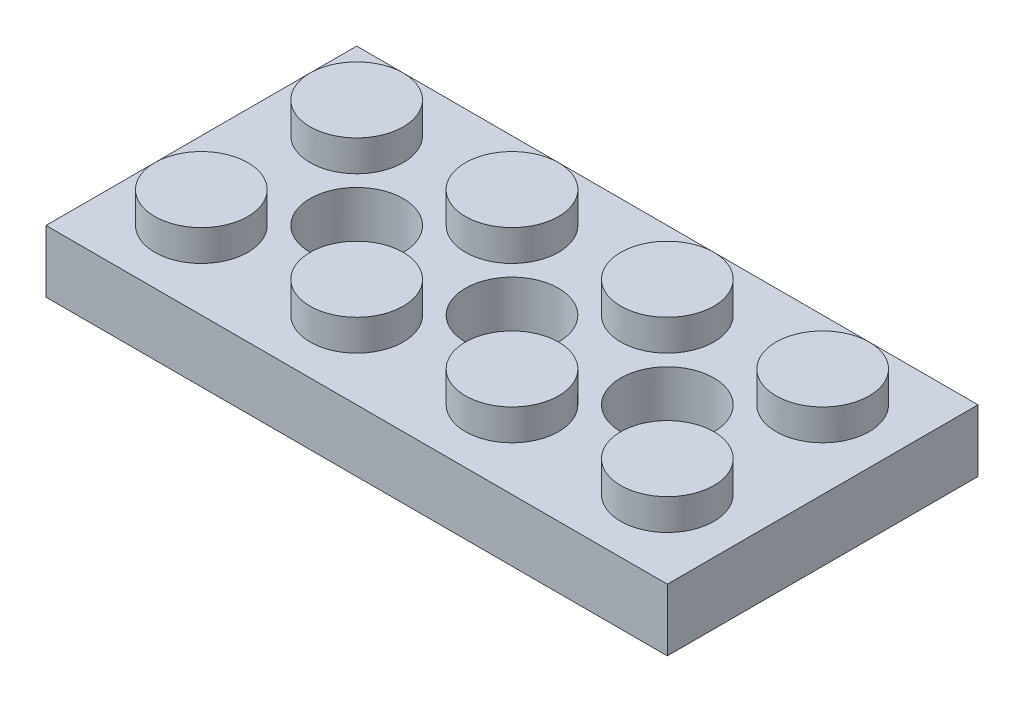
ISO-10303-21;
HEADER;
FILE_DESCRIPTION(('STEP AP214'),'2;1');
FILE_NAME('part.step','',(''),(''),'','','');
FILE_SCHEMA(('AUTOMOTIVE_DESIGN { 1 0 10303 214 1 1 1 1 }'));
ENDSEC;
DATA;
#1=APPLICATION_CONTEXT('core data for automotive mechanical design processes');
#2=APPLICATION_PROTOCOL_DEFINITION('international standard','automotive_design',2000,#1);
#3=PRODUCT_CONTEXT('',#1,'mechanical');
#4=PRODUCT('Part','Part','',(#3));
#5=PRODUCT_RELATED_PRODUCT_CATEGORY('part','',(#4));
#6=PRODUCT_DEFINITION_FORMATION('','',#4);
#7=PRODUCT_DEFINITION_CONTEXT('part definition',#1,'design');
#8=PRODUCT_DEFINITION('design','',#6,#7);
#9=PRODUCT_DEFINITION_SHAPE('','',#8);
#10=(LENGTH_UNIT() NAMED_UNIT(*) SI_UNIT(.MILLI.,.METRE.));
#11=(NAMED_UNIT(*) PLANE_ANGLE_UNIT() SI_UNIT($,.RADIAN.));
#12=(NAMED_UNIT(*) SI_UNIT($,.STERADIAN.) SOLID_ANGLE_UNIT());
#13=UNCERTAINTY_MEASURE_WITH_UNIT(LENGTH_MEASURE(1.E-05),#10,'distance_accuracy_value','');
#14=(GEOMETRIC_REPRESENTATION_CONTEXT(3) GLOBAL_UNCERTAINTY_ASSIGNED_CONTEXT((#13)) GLOBAL_UNIT_ASSIGNED_CONTEXT((#10,
#11,#12)) REPRESENTATION_CONTEXT('',''));
#15=CARTESIAN_POINT('',(0.,0.,0.));
#16=DIRECTION('',(0.,0.,1.));
#17=DIRECTION('',(1.,0.,0.));
#18=AXIS2_PLACEMENT_3D('',#15,#16,#17);
#19=CARTESIAN_POINT('',(0.,0.,0.));
#20=DIRECTION('',(0.,-1.,0.));
#21=DIRECTION('',(0.,0.,-1.));
#22=AXIS2_PLACEMENT_3D('',#19,#20,#21);
#23=PLANE('',#22);
#24=DIRECTION('',(0.,0.,-1.));
#25=VECTOR('',#24,1.);
#26=CARTESIAN_POINT('',(16.,0.,4.));
#27=LINE('',#26,#25);
#28=CARTESIAN_POINT('',(16.,0.,12.));
#29=VERTEX_POINT('',#28);
#30=CARTESIAN_POINT('',(16.,0.,-4.));
#31=VERTEX_POINT('',#30);
#32=EDGE_CURVE('E86',#29,#31,#27,.T.);
#33=ORIENTED_EDGE('',*,*,#32,.F.);
#34=DIRECTION('',(-1.,0.,0.));
#35=VECTOR('',#34,1.);
#36=CARTESIAN_POINT('',(-16.,0.,12.));
#37=LINE('',#36,#35);
#38=CARTESIAN_POINT('',(-16.,0.,12.));
#39=VERTEX_POINT('',#38);
#40=EDGE_CURVE('E99',#29,#39,#37,.T.);
#41=ORIENTED_EDGE('',*,*,#40,.T.);
#42=DIRECTION('',(0.,0.,1.));
#43=VECTOR('',#42,1.);
#44=CARTESIAN_POINT('',(-16.,0.,4.));
#45=LINE('',#44,#43);
#46=CARTESIAN_POINT('',(-16.,0.,-4.));
#47=VERTEX_POINT('',#46);
#48=EDGE_CURVE('E85',#47,#39,#45,.T.);
#49=ORIENTED_EDGE('',*,*,#48,.F.);
#50=DIRECTION('',(-1.,0.,0.));
#51=VECTOR('',#50,1.);
#52=CARTESIAN_POINT('',(-16.,0.,-4.));
#53=LINE('',#52,#51);
#54=EDGE_CURVE('E74',#31,#47,#53,.T.);
#55=ORIENTED_EDGE('',*,*,#54,.F.);
#56=EDGE_LOOP('',(#33,#41,#49,#55));
#57=FACE_BOUND('',#56,.T.);
#58=DIRECTION('',(-1.,0.,0.));
#59=VECTOR('',#58,1.);
#60=CARTESIAN_POINT('',(0.,0.,10.4));
#61=LINE('',#60,#59);
#62=CARTESIAN_POINT('',(14.4,0.,10.4));
#63=VERTEX_POINT('',#62);
#64=CARTESIAN_POINT('',(-14.4,0.,10.4));
#65=VERTEX_POINT('',#64);
#66=EDGE_CURVE('E185',#63,#65,#61,.T.);
#67=ORIENTED_EDGE('',*,*,#66,.F.);
#68=DIRECTION('',(0.,0.,-1.));
#69=VECTOR('',#68,1.);
#70=CARTESIAN_POINT('',(14.4,0.,0.));
#71=LINE('',#70,#69);
#72=CARTESIAN_POINT('',(14.4,0.,-2.4));
#73=VERTEX_POINT('',#72);
#74=EDGE_CURVE('E182',#63,#73,#71,.T.);
#75=ORIENTED_EDGE('',*,*,#74,.T.);
#76=DIRECTION('',(-1.,0.,0.));
#77=VECTOR('',#76,1.);
#78=CARTESIAN_POINT('',(0.,0.,-2.4));
#79=LINE('',#78,#77);
#80=CARTESIAN_POINT('',(-14.4,0.,-2.4));
#81=VERTEX_POINT('',#80);
#82=EDGE_CURVE('E179',#73,#81,#79,.T.);
#83=ORIENTED_EDGE('',*,*,#82,.T.);
#84=DIRECTION('',(0.,0.,1.));
#85=VECTOR('',#84,1.);
#86=CARTESIAN_POINT('',(-14.4,0.,0.));
#87=LINE('',#86,#85);
#88=EDGE_CURVE('E53',#81,#65,#87,.T.);
#89=ORIENTED_EDGE('',*,*,#88,.T.);
#90=EDGE_LOOP('',(#67,#75,#83,#89));
#91=FACE_BOUND('',#90,.T.);
#92=ADVANCED_FACE('F38',(#57,#91),#23,.T.);
#93=CARTESIAN_POINT('',(16.,3.2,4.));
#94=DIRECTION('',(-1.,0.,0.));
#95=DIRECTION('',(0.,0.,1.));
#96=AXIS2_PLACEMENT_3D('',#93,#94,#95);
#97=PLANE('',#96);
#98=ORIENTED_EDGE('',*,*,#32,.T.);
#99=DIRECTION('',(0.,-1.,0.));
#100=VECTOR('',#99,1.);
#101=CARTESIAN_POINT('',(16.,3.2,-4.));
#102=LINE('',#101,#100);
#103=CARTESIAN_POINT('',(16.,3.2,-4.));
#104=VERTEX_POINT('',#103);
#105=EDGE_CURVE('E80',#104,#31,#102,.T.);
#106=ORIENTED_EDGE('',*,*,#105,.F.);
#107=DIRECTION('',(0.,0.,-1.));
#108=VECTOR('',#107,1.);
#109=CARTESIAN_POINT('',(16.,3.2,4.));
#110=LINE('',#109,#108);
#111=CARTESIAN_POINT('',(16.,3.2,12.));
#112=VERTEX_POINT('',#111);
#113=EDGE_CURVE('E100',#112,#104,#110,.T.);
#114=ORIENTED_EDGE('',*,*,#113,.F.);
#115=DIRECTION('',(0.,-1.,0.));
#116=VECTOR('',#115,1.);
#117=CARTESIAN_POINT('',(16.,3.2,12.));
#118=LINE('',#117,#116);
#119=EDGE_CURVE('E133',#112,#29,#118,.T.);
#120=ORIENTED_EDGE('',*,*,#119,.T.);
#121=EDGE_LOOP('',(#98,#106,#114,#120));
#122=FACE_BOUND('',#121,.T.);
#123=ADVANCED_FACE('F40',(#122),#97,.F.);
#124=CARTESIAN_POINT('',(-16.,3.2,-4.));
#125=DIRECTION('',(0.,0.,1.));
#126=DIRECTION('',(1.,0.,0.));
#127=AXIS2_PLACEMENT_3D('',#124,#125,#126);
#128=PLANE('',#127);
#129=ORIENTED_EDGE('',*,*,#54,.T.);
#130=DIRECTION('',(0.,-1.,0.));
#131=VECTOR('',#130,1.);
#132=CARTESIAN_POINT('',(-16.,3.2,-4.));
#133=LINE('',#132,#131);
#134=CARTESIAN_POINT('',(-16.,3.2,-4.));
#135=VERTEX_POINT('',#134);
#136=EDGE_CURVE('E77',#135,#47,#133,.T.);
#137=ORIENTED_EDGE('',*,*,#136,.F.);
#138=DIRECTION('',(-1.,0.,0.));
#139=VECTOR('',#138,1.);
#140=CARTESIAN_POINT('',(-16.,3.2,-4.));
#141=LINE('',#140,#139);
#142=EDGE_CURVE('E62',#104,#135,#141,.T.);
#143=ORIENTED_EDGE('',*,*,#142,.F.);
#144=ORIENTED_EDGE('',*,*,#105,.T.);
#145=EDGE_LOOP('',(#129,#137,#143,#144));
#146=FACE_BOUND('',#145,.T.);
#147=ADVANCED_FACE('F76',(#146),#128,.F.);
#148=CARTESIAN_POINT('',(-16.,3.2,4.));
#149=DIRECTION('',(1.,0.,0.));
#150=DIRECTION('',(0.,0.,-1.));
#151=AXIS2_PLACEMENT_3D('',#148,#149,#150);
#152=PLANE('',#151);
#153=ORIENTED_EDGE('',*,*,#48,.T.);
#154=DIRECTION('',(0.,-1.,0.));
#155=VECTOR('',#154,1.);
#156=CARTESIAN_POINT('',(-16.,3.2,12.));
#157=LINE('',#156,#155);
#158=CARTESIAN_POINT('',(-16.,3.2,12.));
#159=VERTEX_POINT('',#158);
#160=EDGE_CURVE('E149',#159,#39,#157,.T.);
#161=ORIENTED_EDGE('',*,*,#160,.F.);
#162=DIRECTION('',(0.,0.,1.));
#163=VECTOR('',#162,1.);
#164=CARTESIAN_POINT('',(-16.,3.2,4.));
#165=LINE('',#164,#163);
#166=EDGE_CURVE('E94',#135,#159,#165,.T.);
#167=ORIENTED_EDGE('',*,*,#166,.F.);
#168=ORIENTED_EDGE('',*,*,#136,.T.);
#169=EDGE_LOOP('',(#153,#161,#167,#168));
#170=FACE_BOUND('',#169,.T.);
#171=ADVANCED_FACE('F90',(#170),#152,.F.);
#172=CARTESIAN_POINT('',(0.,3.2,0.));
#173=DIRECTION('',(0.,-1.,0.));
#174=DIRECTION('',(0.,0.,-1.));
#175=AXIS2_PLACEMENT_3D('',#172,#173,#174);
#176=PLANE('',#175);
#177=CARTESIAN_POINT('',(0.,3.2,4.));
#178=DIRECTION('',(0.,-1.,0.));
#179=DIRECTION('',(0.,0.,-1.));
#180=AXIS2_PLACEMENT_3D('',#177,#178,#179);
#181=CIRCLE('',#180,2.4);
#182=CARTESIAN_POINT('',(0.,3.2,1.6));
#183=VERTEX_POINT('',#182);
#184=EDGE_CURVE('E282',#183,#183,#181,.F.);
#185=ORIENTED_EDGE('',*,*,#184,.F.);
#186=EDGE_LOOP('',(#185));
#187=FACE_BOUND('',#186,.T.);
#188=CARTESIAN_POINT('',(-8.,3.2,4.));
#189=DIRECTION('',(0.,-1.,0.));
#190=DIRECTION('',(0.,0.,-1.));
#191=AXIS2_PLACEMENT_3D('',#188,#189,#190);
#192=CIRCLE('',#191,2.4);
#193=CARTESIAN_POINT('',(-8.,3.2,1.6));
#194=VERTEX_POINT('',#193);
#195=EDGE_CURVE('E285',#194,#194,#192,.F.);
#196=ORIENTED_EDGE('',*,*,#195,.F.);
#197=EDGE_LOOP('',(#196));
#198=FACE_BOUND('',#197,.T.);
#199=CARTESIAN_POINT('',(8.,3.2,4.));
#200=DIRECTION('',(0.,-1.,0.));
#201=DIRECTION('',(0.,0.,-1.));
#202=AXIS2_PLACEMENT_3D('',#199,#200,#201);
#203=CIRCLE('',#202,2.4);
#204=CARTESIAN_POINT('',(8.,3.2,1.6));
#205=VERTEX_POINT('',#204);
#206=EDGE_CURVE('E264',#205,#205,#203,.F.);
#207=ORIENTED_EDGE('',*,*,#206,.F.);
#208=EDGE_LOOP('',(#207));
#209=FACE_BOUND('',#208,.T.);
#210=CARTESIAN_POINT('',(12.,3.2,8.));
#211=DIRECTION('',(0.,-1.,0.));
#212=DIRECTION('',(0.,0.,-1.));
#213=AXIS2_PLACEMENT_3D('',#210,#211,#212);
#214=CIRCLE('',#213,2.4);
#215=CARTESIAN_POINT('',(12.,3.2,5.6));
#216=VERTEX_POINT('',#215);
#217=EDGE_CURVE('E173',#216,#216,#214,.T.);
#218=ORIENTED_EDGE('',*,*,#217,.T.);
#219=EDGE_LOOP('',(#218));
#220=FACE_BOUND('',#219,.T.);
#221=CARTESIAN_POINT('',(4.,3.2,8.));
#222=DIRECTION('',(0.,-1.,0.));
#223=DIRECTION('',(0.,0.,-1.));
#224=AXIS2_PLACEMENT_3D('',#221,#222,#223);
#225=CIRCLE('',#224,2.4);
#226=CARTESIAN_POINT('',(4.,3.2,5.6));
#227=VERTEX_POINT('',#226);
#228=EDGE_CURVE('E167',#227,#227,#225,.T.);
#229=ORIENTED_EDGE('',*,*,#228,.T.);
#230=EDGE_LOOP('',(#229));
#231=FACE_BOUND('',#230,.T.);
#232=CARTESIAN_POINT('',(-4.,3.2,8.));
#233=DIRECTION('',(0.,-1.,0.));
#234=DIRECTION('',(0.,0.,-1.));
#235=AXIS2_PLACEMENT_3D('',#232,#233,#234);
#236=CIRCLE('',#235,2.4);
#237=CARTESIAN_POINT('',(-4.,3.2,5.6));
#238=VERTEX_POINT('',#237);
#239=EDGE_CURVE('E161',#238,#238,#236,.T.);
#240=ORIENTED_EDGE('',*,*,#239,.T.);
#241=EDGE_LOOP('',(#240));
#242=FACE_BOUND('',#241,.T.);
#243=CARTESIAN_POINT('',(-12.,3.2,8.));
#244=DIRECTION('',(0.,-1.,0.));
#245=DIRECTION('',(0.,0.,-1.));
#246=AXIS2_PLACEMENT_3D('',#243,#244,#245);
#247=CIRCLE('',#246,2.4);
#248=CARTESIAN_POINT('',(-12.,3.2,5.6));
#249=VERTEX_POINT('',#248);
#250=EDGE_CURVE('E155',#249,#249,#247,.T.);
#251=ORIENTED_EDGE('',*,*,#250,.T.);
#252=EDGE_LOOP('',(#251));
#253=FACE_BOUND('',#252,.T.);
#254=CARTESIAN_POINT('',(12.,3.2,0.));
#255=DIRECTION('',(0.,-1.,0.));
#256=DIRECTION('',(0.,0.,-1.));
#257=AXIS2_PLACEMENT_3D('',#254,#255,#256);
#258=CIRCLE('',#257,2.4);
#259=CARTESIAN_POINT('',(12.,3.2,-2.4));
#260=VERTEX_POINT('',#259);
#261=EDGE_CURVE('E11',#260,#260,#258,.F.);
#262=ORIENTED_EDGE('',*,*,#261,.F.);
#263=EDGE_LOOP('',(#262));
#264=FACE_BOUND('',#263,.T.);
#265=CARTESIAN_POINT('',(4.,3.2,0.));
#266=DIRECTION('',(0.,-1.,0.));
#267=DIRECTION('',(0.,0.,-1.));
#268=AXIS2_PLACEMENT_3D('',#265,#266,#267);
#269=CIRCLE('',#268,2.4);
#270=CARTESIAN_POINT('',(4.,3.2,-2.4));
#271=VERTEX_POINT('',#270);
#272=EDGE_CURVE('E46',#271,#271,#269,.F.);
#273=ORIENTED_EDGE('',*,*,#272,.F.);
#274=EDGE_LOOP('',(#273));
#275=FACE_BOUND('',#274,.T.);
#276=CARTESIAN_POINT('',(-4.,3.2,0.));
#277=DIRECTION('',(0.,-1.,0.));
#278=DIRECTION('',(0.,0.,-1.));
#279=AXIS2_PLACEMENT_3D('',#276,#277,#278);
#280=CIRCLE('',#279,2.4);
#281=CARTESIAN_POINT('',(-4.,3.2,-2.4));
#282=VERTEX_POINT('',#281);
#283=EDGE_CURVE('E109',#282,#282,#280,.F.);
#284=ORIENTED_EDGE('',*,*,#283,.F.);
#285=EDGE_LOOP('',(#284));
#286=FACE_BOUND('',#285,.T.);
#287=CARTESIAN_POINT('',(-12.,3.2,0.));
#288=DIRECTION('',(0.,-1.,0.));
#289=DIRECTION('',(0.,0.,-1.));
#290=AXIS2_PLACEMENT_3D('',#287,#288,#289);
#291=CIRCLE('',#290,2.4);
#292=CARTESIAN_POINT('',(-12.,3.2,-2.4));
#293=VERTEX_POINT('',#292);
#294=EDGE_CURVE('E106',#293,#293,#291,.F.);
#295=ORIENTED_EDGE('',*,*,#294,.F.);
#296=EDGE_LOOP('',(#295));
#297=FACE_BOUND('',#296,.T.);
#298=ORIENTED_EDGE('',*,*,#113,.T.);
#299=ORIENTED_EDGE('',*,*,#142,.T.);
#300=ORIENTED_EDGE('',*,*,#166,.T.);
#301=DIRECTION('',(-1.,0.,0.));
#302=VECTOR('',#301,1.);
#303=CARTESIAN_POINT('',(-16.,3.2,12.));
#304=LINE('',#303,#302);
#305=EDGE_CURVE('E128',#112,#159,#304,.T.);
#306=ORIENTED_EDGE('',*,*,#305,.F.);
#307=EDGE_LOOP('',(#298,#299,#300,#306));
#308=FACE_BOUND('',#307,.T.);
#309=ADVANCED_FACE('F116',(#187,#198,#209,#220,#231,#242,#253,#264,#275,#286,#297,#308),#176,.F.);
#310=CARTESIAN_POINT('',(-12.,4.8,0.));
#311=DIRECTION('',(0.,-1.,0.));
#312=DIRECTION('',(0.,0.,-1.));
#313=AXIS2_PLACEMENT_3D('',#310,#311,#312);
#314=CYLINDRICAL_SURFACE('',#313,2.4);
#315=CARTESIAN_POINT('',(-12.,4.8,0.));
#316=DIRECTION('',(0.,1.,0.));
#317=DIRECTION('',(0.,0.,1.));
#318=AXIS2_PLACEMENT_3D('',#315,#316,#317);
#319=CIRCLE('',#318,2.4);
#320=CARTESIAN_POINT('',(-12.,4.8,2.4));
#321=VERTEX_POINT('',#320);
#322=EDGE_CURVE('E134',#321,#321,#319,.T.);
#323=ORIENTED_EDGE('',*,*,#322,.F.);
#324=EDGE_LOOP('',(#323));
#325=FACE_BOUND('',#324,.T.);
#326=ORIENTED_EDGE('',*,*,#294,.T.);
#327=EDGE_LOOP('',(#326));
#328=FACE_BOUND('',#327,.T.);
#329=ADVANCED_FACE('F119',(#325,#328),#314,.T.);
#330=CARTESIAN_POINT('',(-12.,4.8,0.));
#331=DIRECTION('',(0.,1.,0.));
#332=DIRECTION('',(0.,0.,1.));
#333=AXIS2_PLACEMENT_3D('',#330,#331,#332);
#334=PLANE('',#333);
#335=ORIENTED_EDGE('',*,*,#322,.T.);
#336=EDGE_LOOP('',(#335));
#337=FACE_BOUND('',#336,.T.);
#338=ADVANCED_FACE('F365',(#337),#334,.T.);
#339=CARTESIAN_POINT('',(-4.,4.8,0.));
#340=DIRECTION('',(0.,-1.,0.));
#341=DIRECTION('',(0.,0.,-1.));
#342=AXIS2_PLACEMENT_3D('',#339,#340,#341);
#343=CYLINDRICAL_SURFACE('',#342,2.4);
#344=CARTESIAN_POINT('',(-4.,4.8,0.));
#345=DIRECTION('',(0.,1.,0.));
#346=DIRECTION('',(0.,0.,1.));
#347=AXIS2_PLACEMENT_3D('',#344,#345,#346);
#348=CIRCLE('',#347,2.4);
#349=CARTESIAN_POINT('',(-4.,4.8,2.4));
#350=VERTEX_POINT('',#349);
#351=EDGE_CURVE('E136',#350,#350,#348,.T.);
#352=ORIENTED_EDGE('',*,*,#351,.F.);
#353=EDGE_LOOP('',(#352));
#354=FACE_BOUND('',#353,.T.);
#355=ORIENTED_EDGE('',*,*,#283,.T.);
#356=EDGE_LOOP('',(#355));
#357=FACE_BOUND('',#356,.T.);
#358=ADVANCED_FACE('F372',(#354,#357),#343,.T.);
#359=CARTESIAN_POINT('',(-4.,4.8,0.));
#360=DIRECTION('',(0.,1.,0.));
#361=DIRECTION('',(0.,0.,1.));
#362=AXIS2_PLACEMENT_3D('',#359,#360,#361);
#363=PLANE('',#362);
#364=ORIENTED_EDGE('',*,*,#351,.T.);
#365=EDGE_LOOP('',(#364));
#366=FACE_BOUND('',#365,.T.);
#367=ADVANCED_FACE('F380',(#366),#363,.T.);
#368=CARTESIAN_POINT('',(4.,4.8,0.));
#369=DIRECTION('',(0.,-1.,0.));
#370=DIRECTION('',(0.,0.,-1.));
#371=AXIS2_PLACEMENT_3D('',#368,#369,#370);
#372=CYLINDRICAL_SURFACE('',#371,2.4);
#373=CARTESIAN_POINT('',(4.,4.8,0.));
#374=DIRECTION('',(0.,1.,0.));
#375=DIRECTION('',(0.,0.,1.));
#376=AXIS2_PLACEMENT_3D('',#373,#374,#375);
#377=CIRCLE('',#376,2.4);
#378=CARTESIAN_POINT('',(4.,4.8,2.4));
#379=VERTEX_POINT('',#378);
#380=EDGE_CURVE('E143',#379,#379,#377,.T.);
#381=ORIENTED_EDGE('',*,*,#380,.F.);
#382=EDGE_LOOP('',(#381));
#383=FACE_BOUND('',#382,.T.);
#384=ORIENTED_EDGE('',*,*,#272,.T.);
#385=EDGE_LOOP('',(#384));
#386=FACE_BOUND('',#385,.T.);
#387=ADVANCED_FACE('F114',(#383,#386),#372,.T.);
#388=CARTESIAN_POINT('',(4.,4.8,0.));
#389=DIRECTION('',(0.,1.,0.));
#390=DIRECTION('',(0.,0.,1.));
#391=AXIS2_PLACEMENT_3D('',#388,#389,#390);
#392=PLANE('',#391);
#393=ORIENTED_EDGE('',*,*,#380,.T.);
#394=EDGE_LOOP('',(#393));
#395=FACE_BOUND('',#394,.T.);
#396=ADVANCED_FACE('F322',(#395),#392,.T.);
#397=CARTESIAN_POINT('',(12.,4.8,0.));
#398=DIRECTION('',(0.,-1.,0.));
#399=DIRECTION('',(0.,0.,-1.));
#400=AXIS2_PLACEMENT_3D('',#397,#398,#399);
#401=CYLINDRICAL_SURFACE('',#400,2.4);
#402=CARTESIAN_POINT('',(12.,4.8,0.));
#403=DIRECTION('',(0.,1.,0.));
#404=DIRECTION('',(0.,0.,1.));
#405=AXIS2_PLACEMENT_3D('',#402,#403,#404);
#406=CIRCLE('',#405,2.4);
#407=CARTESIAN_POINT('',(12.,4.8,2.4));
#408=VERTEX_POINT('',#407);
#409=EDGE_CURVE('E146',#408,#408,#406,.T.);
#410=ORIENTED_EDGE('',*,*,#409,.F.);
#411=EDGE_LOOP('',(#410));
#412=FACE_BOUND('',#411,.T.);
#413=ORIENTED_EDGE('',*,*,#261,.T.);
#414=EDGE_LOOP('',(#413));
#415=FACE_BOUND('',#414,.T.);
#416=ADVANCED_FACE('F319',(#412,#415),#401,.T.);
#417=CARTESIAN_POINT('',(12.,4.8,0.));
#418=DIRECTION('',(0.,1.,0.));
#419=DIRECTION('',(0.,0.,1.));
#420=AXIS2_PLACEMENT_3D('',#417,#418,#419);
#421=PLANE('',#420);
#422=ORIENTED_EDGE('',*,*,#409,.T.);
#423=EDGE_LOOP('',(#422));
#424=FACE_BOUND('',#423,.T.);
#425=ADVANCED_FACE('F321',(#424),#421,.T.);
#426=CARTESIAN_POINT('',(-16.,3.2,12.));
#427=DIRECTION('',(0.,0.,1.));
#428=DIRECTION('',(1.,0.,0.));
#429=AXIS2_PLACEMENT_3D('',#426,#427,#428);
#430=PLANE('',#429);
#431=ORIENTED_EDGE('',*,*,#40,.F.);
#432=ORIENTED_EDGE('',*,*,#119,.F.);
#433=ORIENTED_EDGE('',*,*,#305,.T.);
#434=ORIENTED_EDGE('',*,*,#160,.T.);
#435=EDGE_LOOP('',(#431,#432,#433,#434));
#436=FACE_BOUND('',#435,.T.);
#437=ADVANCED_FACE('F329',(#436),#430,.T.);
#438=CARTESIAN_POINT('',(-12.,4.8,8.));
#439=DIRECTION('',(0.,-1.,0.));
#440=DIRECTION('',(0.,0.,-1.));
#441=AXIS2_PLACEMENT_3D('',#438,#439,#440);
#442=CYLINDRICAL_SURFACE('',#441,2.4);
#443=CARTESIAN_POINT('',(-12.,4.8,8.));
#444=DIRECTION('',(0.,-1.,0.));
#445=DIRECTION('',(0.,0.,-1.));
#446=AXIS2_PLACEMENT_3D('',#443,#444,#445);
#447=CIRCLE('',#446,2.4);
#448=CARTESIAN_POINT('',(-12.,4.8,5.6));
#449=VERTEX_POINT('',#448);
#450=EDGE_CURVE('E153',#449,#449,#447,.T.);
#451=ORIENTED_EDGE('',*,*,#450,.T.);
#452=EDGE_LOOP('',(#451));
#453=FACE_BOUND('',#452,.T.);
#454=ORIENTED_EDGE('',*,*,#250,.F.);
#455=EDGE_LOOP('',(#454));
#456=FACE_BOUND('',#455,.T.);
#457=ADVANCED_FACE('F436',(#453,#456),#442,.T.);
#458=CARTESIAN_POINT('',(-12.,4.8,8.));
#459=DIRECTION('',(0.,1.,0.));
#460=DIRECTION('',(0.,0.,-1.));
#461=AXIS2_PLACEMENT_3D('',#458,#459,#460);
#462=PLANE('',#461);
#463=ORIENTED_EDGE('',*,*,#450,.F.);
#464=EDGE_LOOP('',(#463));
#465=FACE_BOUND('',#464,.T.);
#466=ADVANCED_FACE('F445',(#465),#462,.T.);
#467=CARTESIAN_POINT('',(-4.,4.8,8.));
#468=DIRECTION('',(0.,-1.,0.));
#469=DIRECTION('',(0.,0.,-1.));
#470=AXIS2_PLACEMENT_3D('',#467,#468,#469);
#471=CYLINDRICAL_SURFACE('',#470,2.4);
#472=CARTESIAN_POINT('',(-4.,4.8,8.));
#473=DIRECTION('',(0.,-1.,0.));
#474=DIRECTION('',(0.,0.,-1.));
#475=AXIS2_PLACEMENT_3D('',#472,#473,#474);
#476=CIRCLE('',#475,2.4);
#477=CARTESIAN_POINT('',(-4.,4.8,5.6));
#478=VERTEX_POINT('',#477);
#479=EDGE_CURVE('E158',#478,#478,#476,.T.);
#480=ORIENTED_EDGE('',*,*,#479,.T.);
#481=EDGE_LOOP('',(#480));
#482=FACE_BOUND('',#481,.T.);
#483=ORIENTED_EDGE('',*,*,#239,.F.);
#484=EDGE_LOOP('',(#483));
#485=FACE_BOUND('',#484,.T.);
#486=ADVANCED_FACE('F454',(#482,#485),#471,.T.);
#487=CARTESIAN_POINT('',(-4.,4.8,8.));
#488=DIRECTION('',(0.,1.,0.));
#489=DIRECTION('',(0.,0.,-1.));
#490=AXIS2_PLACEMENT_3D('',#487,#488,#489);
#491=PLANE('',#490);
#492=ORIENTED_EDGE('',*,*,#479,.F.);
#493=EDGE_LOOP('',(#492));
#494=FACE_BOUND('',#493,.T.);
#495=ADVANCED_FACE('F463',(#494),#491,.T.);
#496=CARTESIAN_POINT('',(4.,4.8,8.));
#497=DIRECTION('',(0.,-1.,0.));
#498=DIRECTION('',(0.,0.,-1.));
#499=AXIS2_PLACEMENT_3D('',#496,#497,#498);
#500=CYLINDRICAL_SURFACE('',#499,2.4);
#501=CARTESIAN_POINT('',(4.,4.8,8.));
#502=DIRECTION('',(0.,-1.,0.));
#503=DIRECTION('',(0.,0.,-1.));
#504=AXIS2_PLACEMENT_3D('',#501,#502,#503);
#505=CIRCLE('',#504,2.4);
#506=CARTESIAN_POINT('',(4.,4.8,5.6));
#507=VERTEX_POINT('',#506);
#508=EDGE_CURVE('E164',#507,#507,#505,.T.);
#509=ORIENTED_EDGE('',*,*,#508,.T.);
#510=EDGE_LOOP('',(#509));
#511=FACE_BOUND('',#510,.T.);
#512=ORIENTED_EDGE('',*,*,#228,.F.);
#513=EDGE_LOOP('',(#512));
#514=FACE_BOUND('',#513,.T.);
#515=ADVANCED_FACE('F472',(#511,#514),#500,.T.);
#516=CARTESIAN_POINT('',(4.,4.8,8.));
#517=DIRECTION('',(0.,1.,0.));
#518=DIRECTION('',(0.,0.,-1.));
#519=AXIS2_PLACEMENT_3D('',#516,#517,#518);
#520=PLANE('',#519);
#521=ORIENTED_EDGE('',*,*,#508,.F.);
#522=EDGE_LOOP('',(#521));
#523=FACE_BOUND('',#522,.T.);
#524=ADVANCED_FACE('F481',(#523),#520,.T.);
#525=CARTESIAN_POINT('',(12.,4.8,8.));
#526=DIRECTION('',(0.,-1.,0.));
#527=DIRECTION('',(0.,0.,-1.));
#528=AXIS2_PLACEMENT_3D('',#525,#526,#527);
#529=CYLINDRICAL_SURFACE('',#528,2.4);
#530=CARTESIAN_POINT('',(12.,4.8,8.));
#531=DIRECTION('',(0.,-1.,0.));
#532=DIRECTION('',(0.,0.,-1.));
#533=AXIS2_PLACEMENT_3D('',#530,#531,#532);
#534=CIRCLE('',#533,2.4);
#535=CARTESIAN_POINT('',(12.,4.8,5.6));
#536=VERTEX_POINT('',#535);
#537=EDGE_CURVE('E170',#536,#536,#534,.T.);
#538=ORIENTED_EDGE('',*,*,#537,.T.);
#539=EDGE_LOOP('',(#538));
#540=FACE_BOUND('',#539,.T.);
#541=ORIENTED_EDGE('',*,*,#217,.F.);
#542=EDGE_LOOP('',(#541));
#543=FACE_BOUND('',#542,.T.);
#544=ADVANCED_FACE('F490',(#540,#543),#529,.T.);
#545=CARTESIAN_POINT('',(12.,4.8,8.));
#546=DIRECTION('',(0.,1.,0.));
#547=DIRECTION('',(0.,0.,-1.));
#548=AXIS2_PLACEMENT_3D('',#545,#546,#547);
#549=PLANE('',#548);
#550=ORIENTED_EDGE('',*,*,#537,.F.);
#551=EDGE_LOOP('',(#550));
#552=FACE_BOUND('',#551,.T.);
#553=ADVANCED_FACE('F499',(#552),#549,.T.);
#554=CARTESIAN_POINT('',(14.4,3.2,4.));
#555=DIRECTION('',(-1.,0.,0.));
#556=DIRECTION('',(0.,0.,1.));
#557=AXIS2_PLACEMENT_3D('',#554,#555,#556);
#558=PLANE('',#557);
#559=ORIENTED_EDGE('',*,*,#74,.F.);
#560=DIRECTION('',(0.,-1.,0.));
#561=VECTOR('',#560,1.);
#562=CARTESIAN_POINT('',(14.4,3.2,10.4));
#563=LINE('',#562,#561);
#564=CARTESIAN_POINT('',(14.4,1.6,10.4));
#565=VERTEX_POINT('',#564);
#566=EDGE_CURVE('E222',#565,#63,#563,.T.);
#567=ORIENTED_EDGE('',*,*,#566,.F.);
#568=DIRECTION('',(0.,0.,-1.));
#569=VECTOR('',#568,1.);
#570=CARTESIAN_POINT('',(14.4,1.6,0.));
#571=LINE('',#570,#569);
#572=CARTESIAN_POINT('',(14.4,1.6,-2.4));
#573=VERTEX_POINT('',#572);
#574=EDGE_CURVE('E184',#565,#573,#571,.T.);
#575=ORIENTED_EDGE('',*,*,#574,.T.);
#576=DIRECTION('',(0.,-1.,0.));
#577=VECTOR('',#576,1.);
#578=CARTESIAN_POINT('',(14.4,3.2,-2.4));
#579=LINE('',#578,#577);
#580=EDGE_CURVE('E227',#573,#73,#579,.T.);
#581=ORIENTED_EDGE('',*,*,#580,.T.);
#582=EDGE_LOOP('',(#559,#567,#575,#581));
#583=FACE_BOUND('',#582,.T.);
#584=ADVANCED_FACE('F508',(#583),#558,.T.);
#585=CARTESIAN_POINT('',(-16.,3.2,-2.4));
#586=DIRECTION('',(0.,0.,1.));
#587=DIRECTION('',(1.,0.,0.));
#588=AXIS2_PLACEMENT_3D('',#585,#586,#587);
#589=PLANE('',#588);
#590=ORIENTED_EDGE('',*,*,#82,.F.);
#591=ORIENTED_EDGE('',*,*,#580,.F.);
#592=DIRECTION('',(-1.,0.,0.));
#593=VECTOR('',#592,1.);
#594=CARTESIAN_POINT('',(0.,1.6,-2.4));
#595=LINE('',#594,#593);
#596=CARTESIAN_POINT('',(-14.4,1.6,-2.4));
#597=VERTEX_POINT('',#596);
#598=EDGE_CURVE('E248',#573,#597,#595,.T.);
#599=ORIENTED_EDGE('',*,*,#598,.T.);
#600=DIRECTION('',(0.,-1.,0.));
#601=VECTOR('',#600,1.);
#602=CARTESIAN_POINT('',(-14.4,3.2,-2.4));
#603=LINE('',#602,#601);
#604=EDGE_CURVE('E247',#597,#81,#603,.T.);
#605=ORIENTED_EDGE('',*,*,#604,.T.);
#606=EDGE_LOOP('',(#590,#591,#599,#605));
#607=FACE_BOUND('',#606,.T.);
#608=ADVANCED_FACE('F524',(#607),#589,.T.);
#609=CARTESIAN_POINT('',(-14.4,3.2,4.));
#610=DIRECTION('',(1.,0.,0.));
#611=DIRECTION('',(0.,0.,-1.));
#612=AXIS2_PLACEMENT_3D('',#609,#610,#611);
#613=PLANE('',#612);
#614=ORIENTED_EDGE('',*,*,#88,.F.);
#615=ORIENTED_EDGE('',*,*,#604,.F.);
#616=DIRECTION('',(0.,0.,1.));
#617=VECTOR('',#616,1.);
#618=CARTESIAN_POINT('',(-14.4,1.6,0.));
#619=LINE('',#618,#617);
#620=CARTESIAN_POINT('',(-14.4,1.6,10.4));
#621=VERTEX_POINT('',#620);
#622=EDGE_CURVE('E244',#597,#621,#619,.T.);
#623=ORIENTED_EDGE('',*,*,#622,.T.);
#624=DIRECTION('',(0.,-1.,0.));
#625=VECTOR('',#624,1.);
#626=CARTESIAN_POINT('',(-14.4,3.2,10.4));
#627=LINE('',#626,#625);
#628=EDGE_CURVE('E212',#621,#65,#627,.T.);
#629=ORIENTED_EDGE('',*,*,#628,.T.);
#630=EDGE_LOOP('',(#614,#615,#623,#629));
#631=FACE_BOUND('',#630,.T.);
#632=ADVANCED_FACE('F536',(#631),#613,.T.);
#633=CARTESIAN_POINT('',(0.,1.6,0.));
#634=DIRECTION('',(0.,-1.,0.));
#635=DIRECTION('',(0.,0.,-1.));
#636=AXIS2_PLACEMENT_3D('',#633,#634,#635);
#637=PLANE('',#636);
#638=CARTESIAN_POINT('',(-8.,1.6,4.));
#639=DIRECTION('',(0.,-1.,0.));
#640=DIRECTION('',(0.,0.,-1.));
#641=AXIS2_PLACEMENT_3D('',#638,#639,#640);
#642=CIRCLE('',#641,3.25);
#643=CARTESIAN_POINT('',(-8.,1.6,0.75));
#644=VERTEX_POINT('',#643);
#645=EDGE_CURVE('E276',#644,#644,#642,.T.);
#646=ORIENTED_EDGE('',*,*,#645,.F.);
#647=EDGE_LOOP('',(#646));
#648=FACE_BOUND('',#647,.T.);
#649=CARTESIAN_POINT('',(0.,1.6,4.));
#650=DIRECTION('',(0.,-1.,0.));
#651=DIRECTION('',(0.,0.,-1.));
#652=AXIS2_PLACEMENT_3D('',#649,#650,#651);
#653=CIRCLE('',#652,3.25);
#654=CARTESIAN_POINT('',(0.,1.6,0.75));
#655=VERTEX_POINT('',#654);
#656=EDGE_CURVE('E270',#655,#655,#653,.T.);
#657=ORIENTED_EDGE('',*,*,#656,.F.);
#658=EDGE_LOOP('',(#657));
#659=FACE_BOUND('',#658,.T.);
#660=CARTESIAN_POINT('',(8.,1.6,4.));
#661=DIRECTION('',(0.,-1.,0.));
#662=DIRECTION('',(0.,0.,-1.));
#663=AXIS2_PLACEMENT_3D('',#660,#661,#662);
#664=CIRCLE('',#663,3.25);
#665=CARTESIAN_POINT('',(8.,1.6,0.75));
#666=VERTEX_POINT('',#665);
#667=EDGE_CURVE('E243',#666,#666,#664,.T.);
#668=ORIENTED_EDGE('',*,*,#667,.F.);
#669=EDGE_LOOP('',(#668));
#670=FACE_BOUND('',#669,.T.);
#671=CARTESIAN_POINT('',(12.,1.6,8.));
#672=DIRECTION('',(0.,-1.,0.));
#673=DIRECTION('',(0.,0.,-1.));
#674=AXIS2_PLACEMENT_3D('',#671,#672,#673);
#675=CIRCLE('',#674,0.800000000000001);
#676=CARTESIAN_POINT('',(12.,1.6,7.2));
#677=VERTEX_POINT('',#676);
#678=EDGE_CURVE('E197',#677,#677,#675,.T.);
#679=ORIENTED_EDGE('',*,*,#678,.F.);
#680=EDGE_LOOP('',(#679));
#681=FACE_BOUND('',#680,.T.);
#682=CARTESIAN_POINT('',(4.,1.6,8.));
#683=DIRECTION('',(0.,-1.,0.));
#684=DIRECTION('',(0.,0.,-1.));
#685=AXIS2_PLACEMENT_3D('',#682,#683,#684);
#686=CIRCLE('',#685,0.800000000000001);
#687=CARTESIAN_POINT('',(4.,1.6,7.2));
#688=VERTEX_POINT('',#687);
#689=EDGE_CURVE('E196',#688,#688,#686,.T.);
#690=ORIENTED_EDGE('',*,*,#689,.F.);
#691=EDGE_LOOP('',(#690));
#692=FACE_BOUND('',#691,.T.);
#693=CARTESIAN_POINT('',(-4.,1.6,8.));
#694=DIRECTION('',(0.,-1.,0.));
#695=DIRECTION('',(0.,0.,-1.));
#696=AXIS2_PLACEMENT_3D('',#693,#694,#695);
#697=CIRCLE('',#696,0.800000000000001);
#698=CARTESIAN_POINT('',(-4.,1.6,7.2));
#699=VERTEX_POINT('',#698);
#700=EDGE_CURVE('E201',#699,#699,#697,.T.);
#701=ORIENTED_EDGE('',*,*,#700,.F.);
#702=EDGE_LOOP('',(#701));
#703=FACE_BOUND('',#702,.T.);
#704=CARTESIAN_POINT('',(-12.,1.6,8.));
#705=DIRECTION('',(0.,-1.,0.));
#706=DIRECTION('',(0.,0.,-1.));
#707=AXIS2_PLACEMENT_3D('',#704,#705,#706);
#708=CIRCLE('',#707,0.800000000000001);
#709=CARTESIAN_POINT('',(-12.,1.6,7.2));
#710=VERTEX_POINT('',#709);
#711=EDGE_CURVE('E205',#710,#710,#708,.T.);
#712=ORIENTED_EDGE('',*,*,#711,.F.);
#713=EDGE_LOOP('',(#712));
#714=FACE_BOUND('',#713,.T.);
#715=CARTESIAN_POINT('',(12.,1.6,0.));
#716=DIRECTION('',(0.,-1.,0.));
#717=DIRECTION('',(0.,0.,-1.));
#718=AXIS2_PLACEMENT_3D('',#715,#716,#717);
#719=CIRCLE('',#718,0.800000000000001);
#720=CARTESIAN_POINT('',(12.,1.6,-0.800000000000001));
#721=VERTEX_POINT('',#720);
#722=EDGE_CURVE('E176',#721,#721,#719,.F.);
#723=ORIENTED_EDGE('',*,*,#722,.T.);
#724=EDGE_LOOP('',(#723));
#725=FACE_BOUND('',#724,.T.);
#726=CARTESIAN_POINT('',(4.,1.6,0.));
#727=DIRECTION('',(0.,-1.,0.));
#728=DIRECTION('',(0.,0.,-1.));
#729=AXIS2_PLACEMENT_3D('',#726,#727,#728);
#730=CIRCLE('',#729,0.800000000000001);
#731=CARTESIAN_POINT('',(4.,1.6,-0.800000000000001));
#732=VERTEX_POINT('',#731);
#733=EDGE_CURVE('E230',#732,#732,#730,.F.);
#734=ORIENTED_EDGE('',*,*,#733,.T.);
#735=EDGE_LOOP('',(#734));
#736=FACE_BOUND('',#735,.T.);
#737=CARTESIAN_POINT('',(-4.,1.6,0.));
#738=DIRECTION('',(0.,-1.,0.));
#739=DIRECTION('',(0.,0.,-1.));
#740=AXIS2_PLACEMENT_3D('',#737,#738,#739);
#741=CIRCLE('',#740,0.800000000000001);
#742=CARTESIAN_POINT('',(-4.,1.6,-0.800000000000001));
#743=VERTEX_POINT('',#742);
#744=EDGE_CURVE('E226',#743,#743,#741,.F.);
#745=ORIENTED_EDGE('',*,*,#744,.T.);
#746=EDGE_LOOP('',(#745));
#747=FACE_BOUND('',#746,.T.);
#748=CARTESIAN_POINT('',(-12.,1.6,0.));
#749=DIRECTION('',(0.,-1.,0.));
#750=DIRECTION('',(0.,0.,-1.));
#751=AXIS2_PLACEMENT_3D('',#748,#749,#750);
#752=CIRCLE('',#751,0.800000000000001);
#753=CARTESIAN_POINT('',(-12.,1.6,-0.800000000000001));
#754=VERTEX_POINT('',#753);
#755=EDGE_CURVE('E223',#754,#754,#752,.F.);
#756=ORIENTED_EDGE('',*,*,#755,.T.);
#757=EDGE_LOOP('',(#756));
#758=FACE_BOUND('',#757,.T.);
#759=ORIENTED_EDGE('',*,*,#574,.F.);
#760=DIRECTION('',(-1.,0.,0.));
#761=VECTOR('',#760,1.);
#762=CARTESIAN_POINT('',(0.,1.6,10.4));
#763=LINE('',#762,#761);
#764=EDGE_CURVE('E188',#565,#621,#763,.T.);
#765=ORIENTED_EDGE('',*,*,#764,.T.);
#766=ORIENTED_EDGE('',*,*,#622,.F.);
#767=ORIENTED_EDGE('',*,*,#598,.F.);
#768=EDGE_LOOP('',(#759,#765,#766,#767));
#769=FACE_BOUND('',#768,.T.);
#770=ADVANCED_FACE('F545',(#648,#659,#670,#681,#692,#703,#714,#725,#736,#747,#758,#769),#637,.T.);
#771=CARTESIAN_POINT('',(-12.,4.8,0.));
#772=DIRECTION('',(0.,-1.,0.));
#773=DIRECTION('',(0.,0.,-1.));
#774=AXIS2_PLACEMENT_3D('',#771,#772,#773);
#775=CYLINDRICAL_SURFACE('',#774,0.800000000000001);
#776=CARTESIAN_POINT('',(-12.,3.2,0.));
#777=DIRECTION('',(0.,1.,0.));
#778=DIRECTION('',(0.,0.,1.));
#779=AXIS2_PLACEMENT_3D('',#776,#777,#778);
#780=CIRCLE('',#779,0.800000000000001);
#781=CARTESIAN_POINT('',(-12.,3.2,0.800000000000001));
#782=VERTEX_POINT('',#781);
#783=EDGE_CURVE('E192',#782,#782,#780,.T.);
#784=ORIENTED_EDGE('',*,*,#783,.T.);
#785=EDGE_LOOP('',(#784));
#786=FACE_BOUND('',#785,.T.);
#787=ORIENTED_EDGE('',*,*,#755,.F.);
#788=EDGE_LOOP('',(#787));
#789=FACE_BOUND('',#788,.T.);
#790=ADVANCED_FACE('F556',(#786,#789),#775,.F.);
#791=CARTESIAN_POINT('',(-12.,3.2,0.));
#792=DIRECTION('',(0.,1.,0.));
#793=DIRECTION('',(0.,0.,1.));
#794=AXIS2_PLACEMENT_3D('',#791,#792,#793);
#795=PLANE('',#794);
#796=ORIENTED_EDGE('',*,*,#783,.F.);
#797=EDGE_LOOP('',(#796));
#798=FACE_BOUND('',#797,.T.);
#799=ADVANCED_FACE('F567',(#798),#795,.F.);
#800=CARTESIAN_POINT('',(-4.,4.8,0.));
#801=DIRECTION('',(0.,-1.,0.));
#802=DIRECTION('',(0.,0.,-1.));
#803=AXIS2_PLACEMENT_3D('',#800,#801,#802);
#804=CYLINDRICAL_SURFACE('',#803,0.800000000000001);
#805=CARTESIAN_POINT('',(-4.,3.2,0.));
#806=DIRECTION('',(0.,1.,0.));
#807=DIRECTION('',(0.,0.,1.));
#808=AXIS2_PLACEMENT_3D('',#805,#806,#807);
#809=CIRCLE('',#808,0.800000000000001);
#810=CARTESIAN_POINT('',(-4.,3.2,0.800000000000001));
#811=VERTEX_POINT('',#810);
#812=EDGE_CURVE('E215',#811,#811,#809,.T.);
#813=ORIENTED_EDGE('',*,*,#812,.T.);
#814=EDGE_LOOP('',(#813));
#815=FACE_BOUND('',#814,.T.);
#816=ORIENTED_EDGE('',*,*,#744,.F.);
#817=EDGE_LOOP('',(#816));
#818=FACE_BOUND('',#817,.T.);
#819=ADVANCED_FACE('F576',(#815,#818),#804,.F.);
#820=CARTESIAN_POINT('',(-4.,3.2,0.));
#821=DIRECTION('',(0.,1.,0.));
#822=DIRECTION('',(0.,0.,1.));
#823=AXIS2_PLACEMENT_3D('',#820,#821,#822);
#824=PLANE('',#823);
#825=ORIENTED_EDGE('',*,*,#812,.F.);
#826=EDGE_LOOP('',(#825));
#827=FACE_BOUND('',#826,.T.);
#828=ADVANCED_FACE('F585',(#827),#824,.F.);
#829=CARTESIAN_POINT('',(4.,4.8,0.));
#830=DIRECTION('',(0.,-1.,0.));
#831=DIRECTION('',(0.,0.,-1.));
#832=AXIS2_PLACEMENT_3D('',#829,#830,#831);
#833=CYLINDRICAL_SURFACE('',#832,0.800000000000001);
#834=CARTESIAN_POINT('',(4.,3.2,0.));
#835=DIRECTION('',(0.,1.,0.));
#836=DIRECTION('',(0.,0.,1.));
#837=AXIS2_PLACEMENT_3D('',#834,#835,#836);
#838=CIRCLE('',#837,0.800000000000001);
#839=CARTESIAN_POINT('',(4.,3.2,0.800000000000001));
#840=VERTEX_POINT('',#839);
#841=EDGE_CURVE('E211',#840,#840,#838,.T.);
#842=ORIENTED_EDGE('',*,*,#841,.T.);
#843=EDGE_LOOP('',(#842));
#844=FACE_BOUND('',#843,.T.);
#845=ORIENTED_EDGE('',*,*,#733,.F.);
#846=EDGE_LOOP('',(#845));
#847=FACE_BOUND('',#846,.T.);
#848=ADVANCED_FACE('F594',(#844,#847),#833,.F.);
#849=CARTESIAN_POINT('',(4.,3.2,0.));
#850=DIRECTION('',(0.,1.,0.));
#851=DIRECTION('',(0.,0.,1.));
#852=AXIS2_PLACEMENT_3D('',#849,#850,#851);
#853=PLANE('',#852);
#854=ORIENTED_EDGE('',*,*,#841,.F.);
#855=EDGE_LOOP('',(#854));
#856=FACE_BOUND('',#855,.T.);
#857=ADVANCED_FACE('F603',(#856),#853,.F.);
#858=CARTESIAN_POINT('',(12.,4.8,0.));
#859=DIRECTION('',(0.,-1.,0.));
#860=DIRECTION('',(0.,0.,-1.));
#861=AXIS2_PLACEMENT_3D('',#858,#859,#860);
#862=CYLINDRICAL_SURFACE('',#861,0.800000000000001);
#863=CARTESIAN_POINT('',(12.,3.2,0.));
#864=DIRECTION('',(0.,1.,0.));
#865=DIRECTION('',(0.,0.,1.));
#866=AXIS2_PLACEMENT_3D('',#863,#864,#865);
#867=CIRCLE('',#866,0.800000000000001);
#868=CARTESIAN_POINT('',(12.,3.2,0.800000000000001));
#869=VERTEX_POINT('',#868);
#870=EDGE_CURVE('E208',#869,#869,#867,.T.);
#871=ORIENTED_EDGE('',*,*,#870,.T.);
#872=EDGE_LOOP('',(#871));
#873=FACE_BOUND('',#872,.T.);
#874=ORIENTED_EDGE('',*,*,#722,.F.);
#875=EDGE_LOOP('',(#874));
#876=FACE_BOUND('',#875,.T.);
#877=ADVANCED_FACE('F612',(#873,#876),#862,.F.);
#878=CARTESIAN_POINT('',(12.,3.2,0.));
#879=DIRECTION('',(0.,1.,0.));
#880=DIRECTION('',(0.,0.,1.));
#881=AXIS2_PLACEMENT_3D('',#878,#879,#880);
#882=PLANE('',#881);
#883=ORIENTED_EDGE('',*,*,#870,.F.);
#884=EDGE_LOOP('',(#883));
#885=FACE_BOUND('',#884,.T.);
#886=ADVANCED_FACE('F621',(#885),#882,.F.);
#887=CARTESIAN_POINT('',(-16.,3.2,10.4));
#888=DIRECTION('',(0.,0.,1.));
#889=DIRECTION('',(1.,0.,0.));
#890=AXIS2_PLACEMENT_3D('',#887,#888,#889);
#891=PLANE('',#890);
#892=ORIENTED_EDGE('',*,*,#66,.T.);
#893=ORIENTED_EDGE('',*,*,#628,.F.);
#894=ORIENTED_EDGE('',*,*,#764,.F.);
#895=ORIENTED_EDGE('',*,*,#566,.T.);
#896=EDGE_LOOP('',(#892,#893,#894,#895));
#897=FACE_BOUND('',#896,.T.);
#898=ADVANCED_FACE('F630',(#897),#891,.F.);
#899=CARTESIAN_POINT('',(-12.,4.8,8.));
#900=DIRECTION('',(0.,-1.,0.));
#901=DIRECTION('',(0.,0.,-1.));
#902=AXIS2_PLACEMENT_3D('',#899,#900,#901);
#903=CYLINDRICAL_SURFACE('',#902,0.800000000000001);
#904=CARTESIAN_POINT('',(-12.,3.2,8.));
#905=DIRECTION('',(0.,1.,0.));
#906=DIRECTION('',(0.,0.,1.));
#907=AXIS2_PLACEMENT_3D('',#904,#905,#906);
#908=CIRCLE('',#907,0.800000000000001);
#909=CARTESIAN_POINT('',(-12.,3.2,8.8));
#910=VERTEX_POINT('',#909);
#911=EDGE_CURVE('E189',#910,#910,#908,.F.);
#912=ORIENTED_EDGE('',*,*,#911,.F.);
#913=EDGE_LOOP('',(#912));
#914=FACE_BOUND('',#913,.T.);
#915=ORIENTED_EDGE('',*,*,#711,.T.);
#916=EDGE_LOOP('',(#915));
#917=FACE_BOUND('',#916,.T.);
#918=ADVANCED_FACE('F639',(#914,#917),#903,.F.);
#919=CARTESIAN_POINT('',(-12.,3.2,8.));
#920=DIRECTION('',(0.,1.,0.));
#921=DIRECTION('',(0.,0.,-1.));
#922=AXIS2_PLACEMENT_3D('',#919,#920,#921);
#923=PLANE('',#922);
#924=ORIENTED_EDGE('',*,*,#911,.T.);
#925=EDGE_LOOP('',(#924));
#926=FACE_BOUND('',#925,.T.);
#927=ADVANCED_FACE('F648',(#926),#923,.F.);
#928=CARTESIAN_POINT('',(-4.,4.8,8.));
#929=DIRECTION('',(0.,-1.,0.));
#930=DIRECTION('',(0.,0.,-1.));
#931=AXIS2_PLACEMENT_3D('',#928,#929,#930);
#932=CYLINDRICAL_SURFACE('',#931,0.800000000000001);
#933=CARTESIAN_POINT('',(-4.,3.2,8.));
#934=DIRECTION('',(0.,1.,0.));
#935=DIRECTION('',(0.,0.,1.));
#936=AXIS2_PLACEMENT_3D('',#933,#934,#935);
#937=CIRCLE('',#936,0.800000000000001);
#938=CARTESIAN_POINT('',(-4.,3.2,8.8));
#939=VERTEX_POINT('',#938);
#940=EDGE_CURVE('E202',#939,#939,#937,.F.);
#941=ORIENTED_EDGE('',*,*,#940,.F.);
#942=EDGE_LOOP('',(#941));
#943=FACE_BOUND('',#942,.T.);
#944=ORIENTED_EDGE('',*,*,#700,.T.);
#945=EDGE_LOOP('',(#944));
#946=FACE_BOUND('',#945,.T.);
#947=ADVANCED_FACE('F657',(#943,#946),#932,.F.);
#948=CARTESIAN_POINT('',(-4.,3.2,8.));
#949=DIRECTION('',(0.,1.,0.));
#950=DIRECTION('',(0.,0.,-1.));
#951=AXIS2_PLACEMENT_3D('',#948,#949,#950);
#952=PLANE('',#951);
#953=ORIENTED_EDGE('',*,*,#940,.T.);
#954=EDGE_LOOP('',(#953));
#955=FACE_BOUND('',#954,.T.);
#956=ADVANCED_FACE('F666',(#955),#952,.F.);
#957=CARTESIAN_POINT('',(4.,4.8,8.));
#958=DIRECTION('',(0.,-1.,0.));
#959=DIRECTION('',(0.,0.,-1.));
#960=AXIS2_PLACEMENT_3D('',#957,#958,#959);
#961=CYLINDRICAL_SURFACE('',#960,0.800000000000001);
#962=CARTESIAN_POINT('',(4.,3.2,8.));
#963=DIRECTION('',(0.,1.,0.));
#964=DIRECTION('',(0.,0.,1.));
#965=AXIS2_PLACEMENT_3D('',#962,#963,#964);
#966=CIRCLE('',#965,0.800000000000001);
#967=CARTESIAN_POINT('',(4.,3.2,8.8));
#968=VERTEX_POINT('',#967);
#969=EDGE_CURVE('E198',#968,#968,#966,.F.);
#970=ORIENTED_EDGE('',*,*,#969,.F.);
#971=EDGE_LOOP('',(#970));
#972=FACE_BOUND('',#971,.T.);
#973=ORIENTED_EDGE('',*,*,#689,.T.);
#974=EDGE_LOOP('',(#973));
#975=FACE_BOUND('',#974,.T.);
#976=ADVANCED_FACE('F675',(#972,#975),#961,.F.);
#977=CARTESIAN_POINT('',(4.,3.2,8.));
#978=DIRECTION('',(0.,1.,0.));
#979=DIRECTION('',(0.,0.,-1.));
#980=AXIS2_PLACEMENT_3D('',#977,#978,#979);
#981=PLANE('',#980);
#982=ORIENTED_EDGE('',*,*,#969,.T.);
#983=EDGE_LOOP('',(#982));
#984=FACE_BOUND('',#983,.T.);
#985=ADVANCED_FACE('F684',(#984),#981,.F.);
#986=CARTESIAN_POINT('',(12.,4.8,8.));
#987=DIRECTION('',(0.,-1.,0.));
#988=DIRECTION('',(0.,0.,-1.));
#989=AXIS2_PLACEMENT_3D('',#986,#987,#988);
#990=CYLINDRICAL_SURFACE('',#989,0.800000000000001);
#991=CARTESIAN_POINT('',(12.,3.2,8.));
#992=DIRECTION('',(0.,1.,0.));
#993=DIRECTION('',(0.,0.,1.));
#994=AXIS2_PLACEMENT_3D('',#991,#992,#993);
#995=CIRCLE('',#994,0.800000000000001);
#996=CARTESIAN_POINT('',(12.,3.2,8.8));
#997=VERTEX_POINT('',#996);
#998=EDGE_CURVE('E193',#997,#997,#995,.F.);
#999=ORIENTED_EDGE('',*,*,#998,.F.);
#1000=EDGE_LOOP('',(#999));
#1001=FACE_BOUND('',#1000,.T.);
#1002=ORIENTED_EDGE('',*,*,#678,.T.);
#1003=EDGE_LOOP('',(#1002));
#1004=FACE_BOUND('',#1003,.T.);
#1005=ADVANCED_FACE('F693',(#1001,#1004),#990,.F.);
#1006=CARTESIAN_POINT('',(12.,3.2,8.));
#1007=DIRECTION('',(0.,1.,0.));
#1008=DIRECTION('',(0.,0.,-1.));
#1009=AXIS2_PLACEMENT_3D('',#1006,#1007,#1008);
#1010=PLANE('',#1009);
#1011=ORIENTED_EDGE('',*,*,#998,.T.);
#1012=EDGE_LOOP('',(#1011));
#1013=FACE_BOUND('',#1012,.T.);
#1014=ADVANCED_FACE('F702',(#1013),#1010,.F.);
#1015=CARTESIAN_POINT('',(8.,0.,4.));
#1016=DIRECTION('',(0.,1.,0.));
#1017=DIRECTION('',(0.,0.,1.));
#1018=AXIS2_PLACEMENT_3D('',#1015,#1016,#1017);
#1019=PLANE('',#1018);
#1020=CARTESIAN_POINT('',(8.,0.,4.));
#1021=DIRECTION('',(0.,1.,0.));
#1022=DIRECTION('',(0.,0.,1.));
#1023=AXIS2_PLACEMENT_3D('',#1020,#1021,#1022);
#1024=CIRCLE('',#1023,2.4);
#1025=CARTESIAN_POINT('',(8.,0.,6.4));
#1026=VERTEX_POINT('',#1025);
#1027=EDGE_CURVE('E267',#1026,#1026,#1024,.T.);
#1028=ORIENTED_EDGE('',*,*,#1027,.T.);
#1029=EDGE_LOOP('',(#1028));
#1030=FACE_BOUND('',#1029,.T.);
#1031=CARTESIAN_POINT('',(8.,0.,4.));
#1032=DIRECTION('',(0.,1.,0.));
#1033=DIRECTION('',(0.,0.,1.));
#1034=AXIS2_PLACEMENT_3D('',#1031,#1032,#1033);
#1035=CIRCLE('',#1034,3.25);
#1036=CARTESIAN_POINT('',(8.,0.,7.25));
#1037=VERTEX_POINT('',#1036);
#1038=EDGE_CURVE('E261',#1037,#1037,#1035,.T.);
#1039=ORIENTED_EDGE('',*,*,#1038,.F.);
#1040=EDGE_LOOP('',(#1039));
#1041=FACE_BOUND('',#1040,.T.);
#1042=ADVANCED_FACE('F711',(#1030,#1041),#1019,.F.);
#1043=CARTESIAN_POINT('',(8.,10.7923881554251,4.));
#1044=DIRECTION('',(0.,-1.,0.));
#1045=DIRECTION('',(0.,0.,-1.));
#1046=AXIS2_PLACEMENT_3D('',#1043,#1044,#1045);
#1047=CYLINDRICAL_SURFACE('',#1046,3.25);
#1048=ORIENTED_EDGE('',*,*,#667,.T.);
#1049=EDGE_LOOP('',(#1048));
#1050=FACE_BOUND('',#1049,.T.);
#1051=ORIENTED_EDGE('',*,*,#1038,.T.);
#1052=EDGE_LOOP('',(#1051));
#1053=FACE_BOUND('',#1052,.T.);
#1054=ADVANCED_FACE('F721',(#1050,#1053),#1047,.T.);
#1055=CARTESIAN_POINT('',(8.,4.8,4.));
#1056=DIRECTION('',(0.,-1.,0.));
#1057=DIRECTION('',(0.,0.,-1.));
#1058=AXIS2_PLACEMENT_3D('',#1055,#1056,#1057);
#1059=CYLINDRICAL_SURFACE('',#1058,2.4);
#1060=ORIENTED_EDGE('',*,*,#1027,.F.);
#1061=EDGE_LOOP('',(#1060));
#1062=FACE_BOUND('',#1061,.T.);
#1063=ORIENTED_EDGE('',*,*,#206,.T.);
#1064=EDGE_LOOP('',(#1063));
#1065=FACE_BOUND('',#1064,.T.);
#1066=ADVANCED_FACE('F729',(#1062,#1065),#1059,.F.);
#1067=CARTESIAN_POINT('',(0.,0.,4.));
#1068=DIRECTION('',(0.,1.,0.));
#1069=DIRECTION('',(0.,0.,1.));
#1070=AXIS2_PLACEMENT_3D('',#1067,#1068,#1069);
#1071=PLANE('',#1070);
#1072=CARTESIAN_POINT('',(0.,0.,4.));
#1073=DIRECTION('',(0.,1.,0.));
#1074=DIRECTION('',(0.,0.,1.));
#1075=AXIS2_PLACEMENT_3D('',#1072,#1073,#1074);
#1076=CIRCLE('',#1075,2.4);
#1077=CARTESIAN_POINT('',(0.,0.,6.4));
#1078=VERTEX_POINT('',#1077);
#1079=EDGE_CURVE('E288',#1078,#1078,#1076,.T.);
#1080=ORIENTED_EDGE('',*,*,#1079,.T.);
#1081=EDGE_LOOP('',(#1080));
#1082=FACE_BOUND('',#1081,.T.);
#1083=CARTESIAN_POINT('',(0.,0.,4.));
#1084=DIRECTION('',(0.,1.,0.));
#1085=DIRECTION('',(0.,0.,1.));
#1086=AXIS2_PLACEMENT_3D('',#1083,#1084,#1085);
#1087=CIRCLE('',#1086,3.25);
#1088=CARTESIAN_POINT('',(0.,0.,7.25));
#1089=VERTEX_POINT('',#1088);
#1090=EDGE_CURVE('E273',#1089,#1089,#1087,.T.);
#1091=ORIENTED_EDGE('',*,*,#1090,.F.);
#1092=EDGE_LOOP('',(#1091));
#1093=FACE_BOUND('',#1092,.T.);
#1094=ADVANCED_FACE('F295',(#1082,#1093),#1071,.F.);
#1095=CARTESIAN_POINT('',(0.,10.7923881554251,4.));
#1096=DIRECTION('',(0.,-1.,0.));
#1097=DIRECTION('',(0.,0.,-1.));
#1098=AXIS2_PLACEMENT_3D('',#1095,#1096,#1097);
#1099=CYLINDRICAL_SURFACE('',#1098,3.25);
#1100=ORIENTED_EDGE('',*,*,#656,.T.);
#1101=EDGE_LOOP('',(#1100));
#1102=FACE_BOUND('',#1101,.T.);
#1103=ORIENTED_EDGE('',*,*,#1090,.T.);
#1104=EDGE_LOOP('',(#1103));
#1105=FACE_BOUND('',#1104,.T.);
#1106=ADVANCED_FACE('F745',(#1102,#1105),#1099,.T.);
#1107=CARTESIAN_POINT('',(-8.,0.,4.));
#1108=DIRECTION('',(0.,1.,0.));
#1109=DIRECTION('',(0.,0.,1.));
#1110=AXIS2_PLACEMENT_3D('',#1107,#1108,#1109);
#1111=PLANE('',#1110);
#1112=CARTESIAN_POINT('',(-8.,0.,4.));
#1113=DIRECTION('',(0.,1.,0.));
#1114=DIRECTION('',(0.,0.,1.));
#1115=AXIS2_PLACEMENT_3D('',#1112,#1113,#1114);
#1116=CIRCLE('',#1115,2.4);
#1117=CARTESIAN_POINT('',(-8.,0.,6.4));
#1118=VERTEX_POINT('',#1117);
#1119=EDGE_CURVE('E289',#1118,#1118,#1116,.T.);
#1120=ORIENTED_EDGE('',*,*,#1119,.T.);
#1121=EDGE_LOOP('',(#1120));
#1122=FACE_BOUND('',#1121,.T.);
#1123=CARTESIAN_POINT('',(-8.,0.,4.));
#1124=DIRECTION('',(0.,1.,0.));
#1125=DIRECTION('',(0.,0.,1.));
#1126=AXIS2_PLACEMENT_3D('',#1123,#1124,#1125);
#1127=CIRCLE('',#1126,3.25);
#1128=CARTESIAN_POINT('',(-8.,0.,7.25));
#1129=VERTEX_POINT('',#1128);
#1130=EDGE_CURVE('E279',#1129,#1129,#1127,.T.);
#1131=ORIENTED_EDGE('',*,*,#1130,.F.);
#1132=EDGE_LOOP('',(#1131));
#1133=FACE_BOUND('',#1132,.T.);
#1134=ADVANCED_FACE('F753',(#1122,#1133),#1111,.F.);
#1135=CARTESIAN_POINT('',(-8.,10.7923881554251,4.));
#1136=DIRECTION('',(0.,-1.,0.));
#1137=DIRECTION('',(0.,0.,-1.));
#1138=AXIS2_PLACEMENT_3D('',#1135,#1136,#1137);
#1139=CYLINDRICAL_SURFACE('',#1138,3.25);
#1140=ORIENTED_EDGE('',*,*,#645,.T.);
#1141=EDGE_LOOP('',(#1140));
#1142=FACE_BOUND('',#1141,.T.);
#1143=ORIENTED_EDGE('',*,*,#1130,.T.);
#1144=EDGE_LOOP('',(#1143));
#1145=FACE_BOUND('',#1144,.T.);
#1146=ADVANCED_FACE('F762',(#1142,#1145),#1139,.T.);
#1147=CARTESIAN_POINT('',(-8.,4.8,4.));
#1148=DIRECTION('',(0.,-1.,0.));
#1149=DIRECTION('',(0.,0.,-1.));
#1150=AXIS2_PLACEMENT_3D('',#1147,#1148,#1149);
#1151=CYLINDRICAL_SURFACE('',#1150,2.4);
#1152=ORIENTED_EDGE('',*,*,#1119,.F.);
#1153=EDGE_LOOP('',(#1152));
#1154=FACE_BOUND('',#1153,.T.);
#1155=ORIENTED_EDGE('',*,*,#195,.T.);
#1156=EDGE_LOOP('',(#1155));
#1157=FACE_BOUND('',#1156,.T.);
#1158=ADVANCED_FACE('F301',(#1154,#1157),#1151,.F.);
#1159=CARTESIAN_POINT('',(0.,4.8,4.));
#1160=DIRECTION('',(0.,-1.,0.));
#1161=DIRECTION('',(0.,0.,-1.));
#1162=AXIS2_PLACEMENT_3D('',#1159,#1160,#1161);
#1163=CYLINDRICAL_SURFACE('',#1162,2.4);
#1164=ORIENTED_EDGE('',*,*,#1079,.F.);
#1165=EDGE_LOOP('',(#1164));
#1166=FACE_BOUND('',#1165,.T.);
#1167=ORIENTED_EDGE('',*,*,#184,.T.);
#1168=EDGE_LOOP('',(#1167));
#1169=FACE_BOUND('',#1168,.T.);
#1170=ADVANCED_FACE('F298',(#1166,#1169),#1163,.F.);
#1171=CLOSED_SHELL('',(#92,#123,#147,#171,#309,#329,#338,#358,#367,#387,#396,#416,#425,#437,
#457,#466,#486,#495,#515,#524,#544,#553,#584,#608,#632,#770,#790,#799,#819,#828,#848,#857,#877,
#886,#898,#918,#927,#947,#956,#976,#985,#1005,#1014,#1042,#1054,#1066,#1094,#1106,#1134,#1146,
#1158,#1170));
#1172=MANIFOLD_SOLID_BREP('B2',#1171);
#1173=ADVANCED_BREP_SHAPE_REPRESENTATION('',(#18,#1172),#14);
#1174=SHAPE_DEFINITION_REPRESENTATION(#9,#1173);
ENDSEC;
END-ISO-10303-21;
